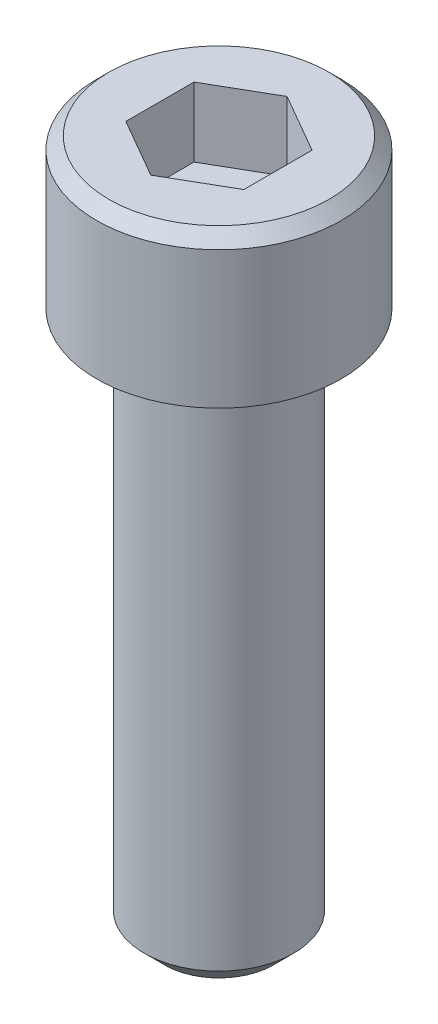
ISO-10303-21;
HEADER;
FILE_DESCRIPTION(('STEP AP214'),'2;1');
FILE_NAME('part.step','',(''),(''),'','','');
FILE_SCHEMA(('AUTOMOTIVE_DESIGN { 1 0 10303 214 1 1 1 1 }'));
ENDSEC;
DATA;
#1=APPLICATION_CONTEXT('core data for automotive mechanical design processes');
#2=APPLICATION_PROTOCOL_DEFINITION('international standard','automotive_design',2000,#1);
#3=PRODUCT_CONTEXT('',#1,'mechanical');
#4=PRODUCT('Part','Part','',(#3));
#5=PRODUCT_RELATED_PRODUCT_CATEGORY('part','',(#4));
#6=PRODUCT_DEFINITION_FORMATION('','',#4);
#7=PRODUCT_DEFINITION_CONTEXT('part definition',#1,'design');
#8=PRODUCT_DEFINITION('design','',#6,#7);
#9=PRODUCT_DEFINITION_SHAPE('','',#8);
#10=(LENGTH_UNIT() NAMED_UNIT(*) SI_UNIT(.MILLI.,.METRE.));
#11=(NAMED_UNIT(*) PLANE_ANGLE_UNIT() SI_UNIT($,.RADIAN.));
#12=(NAMED_UNIT(*) SI_UNIT($,.STERADIAN.) SOLID_ANGLE_UNIT());
#13=UNCERTAINTY_MEASURE_WITH_UNIT(LENGTH_MEASURE(1.E-05),#10,'distance_accuracy_value','');
#14=(GEOMETRIC_REPRESENTATION_CONTEXT(3) GLOBAL_UNCERTAINTY_ASSIGNED_CONTEXT((#13)) GLOBAL_UNIT_ASSIGNED_CONTEXT((#10,
#11,#12)) REPRESENTATION_CONTEXT('',''));
#15=CARTESIAN_POINT('',(0.,0.,0.));
#16=DIRECTION('',(0.,0.,1.));
#17=DIRECTION('',(1.,0.,0.));
#18=AXIS2_PLACEMENT_3D('',#15,#16,#17);
#19=CARTESIAN_POINT('',(-1.11022302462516E-13,8.88178419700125E-13,0.));
#20=DIRECTION('',(0.,-1.00000000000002,0.));
#21=DIRECTION('',(0.,0.,-0.999999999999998));
#22=AXIS2_PLACEMENT_3D('',#19,#20,#21);
#23=PLANE('',#22);
#24=CARTESIAN_POINT('',(-1.11022302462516E-13,8.88178419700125E-13,0.));
#25=DIRECTION('',(0.,-1.00000000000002,0.));
#26=DIRECTION('',(0.,0.,-0.999999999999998));
#27=AXIS2_PLACEMENT_3D('',#24,#25,#26);
#28=CIRCLE('',#27,1.7526);
#29=CARTESIAN_POINT('',(-1.10681791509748E-13,8.89601269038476E-13,-1.75260000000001));
#30=VERTEX_POINT('',#29);
#31=EDGE_CURVE('E11',#30,#30,#28,.T.);
#32=ORIENTED_EDGE('',*,*,#31,.F.);
#33=EDGE_LOOP('',(#32));
#34=FACE_BOUND('',#33,.T.);
#35=CARTESIAN_POINT('',(-1.11022302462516E-13,8.88178419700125E-13,0.));
#36=DIRECTION('',(0.,-1.00000000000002,0.));
#37=DIRECTION('',(0.,0.,-0.999999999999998));
#38=AXIS2_PLACEMENT_3D('',#35,#36,#37);
#39=CIRCLE('',#38,2.8702);
#40=CARTESIAN_POINT('',(-1.10464654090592E-13,8.90508593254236E-13,-2.87020000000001));
#41=VERTEX_POINT('',#40);
#42=EDGE_CURVE('E39',#41,#41,#39,.T.);
#43=ORIENTED_EDGE('',*,*,#42,.T.);
#44=EDGE_LOOP('',(#43));
#45=FACE_BOUND('',#44,.T.);
#46=ADVANCED_FACE('F32',(#34,#45),#23,.T.);
#47=CARTESIAN_POINT('',(-1.11022302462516E-13,8.88178419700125E-13,0.));
#48=DIRECTION('',(0.,-1.00000000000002,0.));
#49=DIRECTION('',(0.,0.,-0.999999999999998));
#50=AXIS2_PLACEMENT_3D('',#47,#48,#49);
#51=CYLINDRICAL_SURFACE('',#50,2.8702);
#52=CARTESIAN_POINT('',(0.,3.21817999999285,0.));
#53=DIRECTION('',(0.,-1.00000000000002,0.));
#54=DIRECTION('',(0.,0.,-0.999999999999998));
#55=AXIS2_PLACEMENT_3D('',#52,#53,#54);
#56=CIRCLE('',#55,2.8702);
#57=CARTESIAN_POINT('',(0.,3.21817999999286,-2.87020000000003));
#58=VERTEX_POINT('',#57);
#59=EDGE_CURVE('E149',#58,#58,#56,.T.);
#60=ORIENTED_EDGE('',*,*,#59,.T.);
#61=EDGE_LOOP('',(#60));
#62=FACE_BOUND('',#61,.T.);
#63=ORIENTED_EDGE('',*,*,#42,.F.);
#64=EDGE_LOOP('',(#63));
#65=FACE_BOUND('',#64,.T.);
#66=ADVANCED_FACE('F155',(#62,#65),#51,.T.);
#67=CARTESIAN_POINT('',(0.,3.21817999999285,0.));
#68=DIRECTION('',(0.,-1.00000000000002,0.));
#69=DIRECTION('',(0.,0.,-0.999999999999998));
#70=AXIS2_PLACEMENT_3D('',#67,#68,#69);
#71=CONICAL_SURFACE('',#70,2.8702,0.785398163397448);
#72=CARTESIAN_POINT('',(0.,3.50519999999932,0.));
#73=DIRECTION('',(0.,-1.00000000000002,0.));
#74=DIRECTION('',(0.,0.,-0.999999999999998));
#75=AXIS2_PLACEMENT_3D('',#72,#73,#74);
#76=CIRCLE('',#75,2.58318);
#77=CARTESIAN_POINT('',(0.,3.50519999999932,-2.58317999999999));
#78=VERTEX_POINT('',#77);
#79=EDGE_CURVE('E146',#78,#78,#76,.T.);
#80=ORIENTED_EDGE('',*,*,#79,.T.);
#81=EDGE_LOOP('',(#80));
#82=FACE_BOUND('',#81,.T.);
#83=ORIENTED_EDGE('',*,*,#59,.F.);
#84=EDGE_LOOP('',(#83));
#85=FACE_BOUND('',#84,.T.);
#86=ADVANCED_FACE('F157',(#82,#85),#71,.T.);
#87=CARTESIAN_POINT('',(2.58317999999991,3.50519999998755,0.));
#88=DIRECTION('',(0.,1.00000000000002,0.));
#89=DIRECTION('',(0.,0.,0.999999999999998));
#90=AXIS2_PLACEMENT_3D('',#87,#88,#89);
#91=PLANE('',#90);
#92=DIRECTION('',(1.02058361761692E-11,0.,0.999999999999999));
#93=VECTOR('',#92,1.);
#94=CARTESIAN_POINT('',(-1.38430000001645,3.50519999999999,-0.799225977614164));
#95=LINE('',#94,#93);
#96=CARTESIAN_POINT('',(-1.38430000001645,3.50519999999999,-0.799225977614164));
#97=VERTEX_POINT('',#96);
#98=CARTESIAN_POINT('',(-1.38430000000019,3.50519999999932,0.79922597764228));
#99=VERTEX_POINT('',#98);
#100=EDGE_CURVE('E46',#97,#99,#95,.T.);
#101=ORIENTED_EDGE('',*,*,#100,.F.);
#102=DIRECTION('',(-0.866025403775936,0.,0.500000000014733));
#103=VECTOR('',#102,1.);
#104=CARTESIAN_POINT('',(-2.46608289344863E-11,3.50520000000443,-1.59845195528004));
#105=LINE('',#104,#103);
#106=CARTESIAN_POINT('',(-2.46608289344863E-11,3.50520000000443,-1.59845195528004));
#107=VERTEX_POINT('',#106);
#108=EDGE_CURVE('E116',#107,#97,#105,.T.);
#109=ORIENTED_EDGE('',*,*,#108,.F.);
#110=DIRECTION('',(-0.866025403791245,0.,-0.499999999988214));
#111=VECTOR('',#110,1.);
#112=CARTESIAN_POINT('',(1.38429999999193,3.50520000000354,-0.799225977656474));
#113=LINE('',#112,#111);
#114=CARTESIAN_POINT('',(1.38429999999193,3.50520000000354,-0.799225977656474));
#115=VERTEX_POINT('',#114);
#116=EDGE_CURVE('E110',#115,#107,#113,.T.);
#117=ORIENTED_EDGE('',*,*,#116,.F.);
#118=DIRECTION('',(-1.02058361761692E-11,0.,-0.999999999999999));
#119=VECTOR('',#118,1.);
#120=CARTESIAN_POINT('',(1.3843000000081,3.50520000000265,0.799225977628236));
#121=LINE('',#120,#119);
#122=CARTESIAN_POINT('',(1.3843000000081,3.50520000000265,0.799225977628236));
#123=VERTEX_POINT('',#122);
#124=EDGE_CURVE('E108',#123,#115,#121,.T.);
#125=ORIENTED_EDGE('',*,*,#124,.F.);
#126=DIRECTION('',(0.866025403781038,0.,-0.500000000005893));
#127=VECTOR('',#126,1.);
#128=CARTESIAN_POINT('',(8.15320033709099E-12,3.50520000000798,1.59845195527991));
#129=LINE('',#128,#127);
#130=CARTESIAN_POINT('',(8.15320033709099E-12,3.50520000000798,1.59845195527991));
#131=VERTEX_POINT('',#130);
#132=EDGE_CURVE('E89',#131,#123,#129,.T.);
#133=ORIENTED_EDGE('',*,*,#132,.F.);
#134=DIRECTION('',(0.866025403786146,0.,0.499999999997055));
#135=VECTOR('',#134,1.);
#136=CARTESIAN_POINT('',(-1.38430000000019,3.50519999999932,0.79922597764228));
#137=LINE('',#136,#135);
#138=EDGE_CURVE('E100',#99,#131,#137,.T.);
#139=ORIENTED_EDGE('',*,*,#138,.F.);
#140=EDGE_LOOP('',(#101,#109,#117,#125,#133,#139));
#141=FACE_BOUND('',#140,.T.);
#142=ORIENTED_EDGE('',*,*,#79,.F.);
#143=EDGE_LOOP('',(#142));
#144=FACE_BOUND('',#143,.T.);
#145=ADVANCED_FACE('F104',(#141,#144),#91,.T.);
#146=CARTESIAN_POINT('',(0.,-12.7000000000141,0.));
#147=DIRECTION('',(0.,-1.00000000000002,0.));
#148=DIRECTION('',(0.,0.,-0.999999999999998));
#149=AXIS2_PLACEMENT_3D('',#146,#147,#148);
#150=PLANE('',#149);
#151=CARTESIAN_POINT('',(0.,-12.7000000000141,0.));
#152=DIRECTION('',(0.,-1.00000000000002,0.));
#153=DIRECTION('',(0.,0.,-0.999999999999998));
#154=AXIS2_PLACEMENT_3D('',#151,#152,#153);
#155=CIRCLE('',#154,1.28016);
#156=CARTESIAN_POINT('',(0.,-12.7000000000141,-1.28016000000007));
#157=VERTEX_POINT('',#156);
#158=EDGE_CURVE('E143',#157,#157,#155,.T.);
#159=ORIENTED_EDGE('',*,*,#158,.T.);
#160=EDGE_LOOP('',(#159));
#161=FACE_BOUND('',#160,.T.);
#162=ADVANCED_FACE('F169',(#161),#150,.T.);
#163=CARTESIAN_POINT('',(0.,-12.7000000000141,0.));
#164=DIRECTION('',(0.,1.00000000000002,0.));
#165=DIRECTION('',(0.,0.,0.999999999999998));
#166=AXIS2_PLACEMENT_3D('',#163,#164,#165);
#167=CONICAL_SURFACE('',#166,1.28016,0.785398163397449);
#168=CARTESIAN_POINT('',(0.,-12.2275600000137,0.));
#169=DIRECTION('',(0.,-1.00000000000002,0.));
#170=DIRECTION('',(0.,0.,-0.999999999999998));
#171=AXIS2_PLACEMENT_3D('',#168,#169,#170);
#172=CIRCLE('',#171,1.7526);
#173=CARTESIAN_POINT('',(0.,-12.2275600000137,-1.7526));
#174=VERTEX_POINT('',#173);
#175=EDGE_CURVE('E134',#174,#174,#172,.T.);
#176=ORIENTED_EDGE('',*,*,#175,.T.);
#177=EDGE_LOOP('',(#176));
#178=FACE_BOUND('',#177,.T.);
#179=ORIENTED_EDGE('',*,*,#158,.F.);
#180=EDGE_LOOP('',(#179));
#181=FACE_BOUND('',#180,.T.);
#182=ADVANCED_FACE('F172',(#178,#181),#167,.T.);
#183=CARTESIAN_POINT('',(-1.11022302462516E-13,8.88178419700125E-13,0.));
#184=DIRECTION('',(0.,-1.00000000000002,0.));
#185=DIRECTION('',(0.,0.,-0.999999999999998));
#186=AXIS2_PLACEMENT_3D('',#183,#184,#185);
#187=CYLINDRICAL_SURFACE('',#186,1.7526);
#188=ORIENTED_EDGE('',*,*,#31,.T.);
#189=EDGE_LOOP('',(#188));
#190=FACE_BOUND('',#189,.T.);
#191=ORIENTED_EDGE('',*,*,#175,.F.);
#192=EDGE_LOOP('',(#191));
#193=FACE_BOUND('',#192,.T.);
#194=ADVANCED_FACE('F176',(#190,#193),#187,.T.);
#195=CARTESIAN_POINT('',(-1.38430000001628,1.87960000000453,-0.799225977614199));
#196=DIRECTION('',(-1.,0.,1.02065855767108E-11));
#197=DIRECTION('',(1.02058361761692E-11,0.,0.999999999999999));
#198=AXIS2_PLACEMENT_3D('',#195,#196,#197);
#199=PLANE('',#198);
#200=ORIENTED_EDGE('',*,*,#100,.T.);
#201=DIRECTION('',(0.,1.00000000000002,0.));
#202=VECTOR('',#201,1.);
#203=CARTESIAN_POINT('',(-1.3843000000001,1.87960000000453,0.799225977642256));
#204=LINE('',#203,#202);
#205=CARTESIAN_POINT('',(-1.3843000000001,1.87960000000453,0.799225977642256));
#206=VERTEX_POINT('',#205);
#207=EDGE_CURVE('E97',#206,#99,#204,.T.);
#208=ORIENTED_EDGE('',*,*,#207,.F.);
#209=DIRECTION('',(1.02058361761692E-11,0.,0.999999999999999));
#210=VECTOR('',#209,1.);
#211=CARTESIAN_POINT('',(-1.38430000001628,1.87960000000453,-0.799225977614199));
#212=LINE('',#211,#210);
#213=CARTESIAN_POINT('',(-1.38430000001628,1.87960000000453,-0.799225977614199));
#214=VERTEX_POINT('',#213);
#215=EDGE_CURVE('E118',#214,#206,#212,.T.);
#216=ORIENTED_EDGE('',*,*,#215,.F.);
#217=DIRECTION('',(0.,1.00000000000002,0.));
#218=VECTOR('',#217,1.);
#219=CARTESIAN_POINT('',(-1.38430000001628,1.87960000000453,-0.799225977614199));
#220=LINE('',#219,#218);
#221=EDGE_CURVE('E53',#214,#97,#220,.T.);
#222=ORIENTED_EDGE('',*,*,#221,.T.);
#223=EDGE_LOOP('',(#200,#208,#216,#222));
#224=FACE_BOUND('',#223,.T.);
#225=ADVANCED_FACE('F180',(#224),#199,.F.);
#226=CARTESIAN_POINT('',(-2.45775622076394E-11,1.87959999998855,-1.59845195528));
#227=DIRECTION('',(-0.500000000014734,0.,-0.866025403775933));
#228=DIRECTION('',(-0.866025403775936,0.,0.500000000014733));
#229=AXIS2_PLACEMENT_3D('',#226,#227,#228);
#230=PLANE('',#229);
#231=ORIENTED_EDGE('',*,*,#108,.T.);
#232=ORIENTED_EDGE('',*,*,#221,.F.);
#233=DIRECTION('',(-0.866025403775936,0.,0.500000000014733));
#234=VECTOR('',#233,1.);
#235=CARTESIAN_POINT('',(-2.45775622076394E-11,1.87959999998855,-1.59845195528));
#236=LINE('',#235,#234);
#237=CARTESIAN_POINT('',(-2.45775622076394E-11,1.87959999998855,-1.59845195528));
#238=VERTEX_POINT('',#237);
#239=EDGE_CURVE('E130',#238,#214,#236,.T.);
#240=ORIENTED_EDGE('',*,*,#239,.F.);
#241=DIRECTION('',(0.,1.00000000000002,0.));
#242=VECTOR('',#241,1.);
#243=CARTESIAN_POINT('',(-2.45775622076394E-11,1.87959999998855,-1.59845195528));
#244=LINE('',#243,#242);
#245=EDGE_CURVE('E135',#238,#107,#244,.T.);
#246=ORIENTED_EDGE('',*,*,#245,.T.);
#247=EDGE_LOOP('',(#231,#232,#240,#246));
#248=FACE_BOUND('',#247,.T.);
#249=ADVANCED_FACE('F184',(#248),#230,.F.);
#250=CARTESIAN_POINT('',(1.38429999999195,1.87959999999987,-0.799225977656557));
#251=DIRECTION('',(0.49999999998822,0.,-0.86602540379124));
#252=DIRECTION('',(-0.866025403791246,0.,-0.499999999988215));
#253=AXIS2_PLACEMENT_3D('',#250,#251,#252);
#254=PLANE('',#253);
#255=ORIENTED_EDGE('',*,*,#116,.T.);
#256=ORIENTED_EDGE('',*,*,#245,.F.);
#257=DIRECTION('',(-0.866025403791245,0.,-0.499999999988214));
#258=VECTOR('',#257,1.);
#259=CARTESIAN_POINT('',(1.38429999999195,1.87959999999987,-0.799225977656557));
#260=LINE('',#259,#258);
#261=CARTESIAN_POINT('',(1.38429999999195,1.87959999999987,-0.799225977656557));
#262=VERTEX_POINT('',#261);
#263=EDGE_CURVE('E127',#262,#238,#260,.T.);
#264=ORIENTED_EDGE('',*,*,#263,.F.);
#265=DIRECTION('',(0.,1.00000000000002,0.));
#266=VECTOR('',#265,1.);
#267=CARTESIAN_POINT('',(1.38429999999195,1.87959999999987,-0.799225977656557));
#268=LINE('',#267,#266);
#269=EDGE_CURVE('E137',#262,#115,#268,.T.);
#270=ORIENTED_EDGE('',*,*,#269,.T.);
#271=EDGE_LOOP('',(#255,#256,#264,#270));
#272=FACE_BOUND('',#271,.T.);
#273=ADVANCED_FACE('F193',(#272),#254,.F.);
#274=CARTESIAN_POINT('',(1.38430000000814,1.87959999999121,0.799225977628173));
#275=DIRECTION('',(1.,0.,-1.02065855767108E-11));
#276=DIRECTION('',(-1.02058361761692E-11,0.,-0.999999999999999));
#277=AXIS2_PLACEMENT_3D('',#274,#275,#276);
#278=PLANE('',#277);
#279=ORIENTED_EDGE('',*,*,#124,.T.);
#280=ORIENTED_EDGE('',*,*,#269,.F.);
#281=DIRECTION('',(-1.02058361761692E-11,0.,-0.999999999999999));
#282=VECTOR('',#281,1.);
#283=CARTESIAN_POINT('',(1.38430000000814,1.87959999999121,0.799225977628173));
#284=LINE('',#283,#282);
#285=CARTESIAN_POINT('',(1.38430000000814,1.87959999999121,0.799225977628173));
#286=VERTEX_POINT('',#285);
#287=EDGE_CURVE('E124',#286,#262,#284,.T.);
#288=ORIENTED_EDGE('',*,*,#287,.F.);
#289=DIRECTION('',(0.,1.00000000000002,0.));
#290=VECTOR('',#289,1.);
#291=CARTESIAN_POINT('',(1.38430000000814,1.87959999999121,0.799225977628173));
#292=LINE('',#291,#290);
#293=EDGE_CURVE('E96',#286,#123,#292,.T.);
#294=ORIENTED_EDGE('',*,*,#293,.T.);
#295=EDGE_LOOP('',(#279,#280,#288,#294));
#296=FACE_BOUND('',#295,.T.);
#297=ADVANCED_FACE('F190',(#296),#278,.F.);
#298=CARTESIAN_POINT('',(7.93115573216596E-12,1.87960000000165,1.59845195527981));
#299=DIRECTION('',(0.500000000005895,0.,0.866025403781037));
#300=DIRECTION('',(0.866025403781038,0.,-0.500000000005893));
#301=AXIS2_PLACEMENT_3D('',#298,#299,#300);
#302=PLANE('',#301);
#303=ORIENTED_EDGE('',*,*,#132,.T.);
#304=ORIENTED_EDGE('',*,*,#293,.F.);
#305=DIRECTION('',(0.866025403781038,0.,-0.500000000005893));
#306=VECTOR('',#305,1.);
#307=CARTESIAN_POINT('',(7.93115573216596E-12,1.87960000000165,1.59845195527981));
#308=LINE('',#307,#306);
#309=CARTESIAN_POINT('',(7.93115573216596E-12,1.87960000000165,1.59845195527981));
#310=VERTEX_POINT('',#309);
#311=EDGE_CURVE('E92',#310,#286,#308,.T.);
#312=ORIENTED_EDGE('',*,*,#311,.F.);
#313=DIRECTION('',(0.,1.00000000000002,0.));
#314=VECTOR('',#313,1.);
#315=CARTESIAN_POINT('',(7.93115573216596E-12,1.87960000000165,1.59845195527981));
#316=LINE('',#315,#314);
#317=EDGE_CURVE('E85',#310,#131,#316,.T.);
#318=ORIENTED_EDGE('',*,*,#317,.T.);
#319=EDGE_LOOP('',(#303,#304,#312,#318));
#320=FACE_BOUND('',#319,.T.);
#321=ADVANCED_FACE('F87',(#320),#302,.F.);
#322=CARTESIAN_POINT('',(-1.3843000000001,1.87960000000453,0.799225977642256));
#323=DIRECTION('',(-0.499999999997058,0.,0.86602540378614));
#324=DIRECTION('',(0.866025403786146,0.,0.499999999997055));
#325=AXIS2_PLACEMENT_3D('',#322,#323,#324);
#326=PLANE('',#325);
#327=ORIENTED_EDGE('',*,*,#138,.T.);
#328=ORIENTED_EDGE('',*,*,#317,.F.);
#329=DIRECTION('',(0.866025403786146,0.,0.499999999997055));
#330=VECTOR('',#329,1.);
#331=CARTESIAN_POINT('',(-1.3843000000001,1.87960000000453,0.799225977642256));
#332=LINE('',#331,#330);
#333=EDGE_CURVE('E121',#206,#310,#332,.T.);
#334=ORIENTED_EDGE('',*,*,#333,.F.);
#335=ORIENTED_EDGE('',*,*,#207,.T.);
#336=EDGE_LOOP('',(#327,#328,#334,#335));
#337=FACE_BOUND('',#336,.T.);
#338=ADVANCED_FACE('F101',(#337),#326,.F.);
#339=CARTESIAN_POINT('',(-1.38429999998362,1.87959999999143,2.397677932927));
#340=DIRECTION('',(0.,1.00000000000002,0.));
#341=DIRECTION('',(0.,0.,0.999999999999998));
#342=AXIS2_PLACEMENT_3D('',#339,#340,#341);
#343=PLANE('',#342);
#344=ORIENTED_EDGE('',*,*,#215,.T.);
#345=ORIENTED_EDGE('',*,*,#333,.T.);
#346=ORIENTED_EDGE('',*,*,#311,.T.);
#347=ORIENTED_EDGE('',*,*,#287,.T.);
#348=ORIENTED_EDGE('',*,*,#263,.T.);
#349=ORIENTED_EDGE('',*,*,#239,.T.);
#350=EDGE_LOOP('',(#344,#345,#346,#347,#348,#349));
#351=FACE_BOUND('',#350,.T.);
#352=ADVANCED_FACE('F187',(#351),#343,.T.);
#353=CLOSED_SHELL('',(#46,#66,#86,#145,#162,#182,#194,#225,#249,#273,#297,#321,#338,#352));
#354=MANIFOLD_SOLID_BREP('B2',#353);
#355=ADVANCED_BREP_SHAPE_REPRESENTATION('',(#18,#354),#14);
#356=SHAPE_DEFINITION_REPRESENTATION(#9,#355);
ENDSEC;
END-ISO-10303-21;
